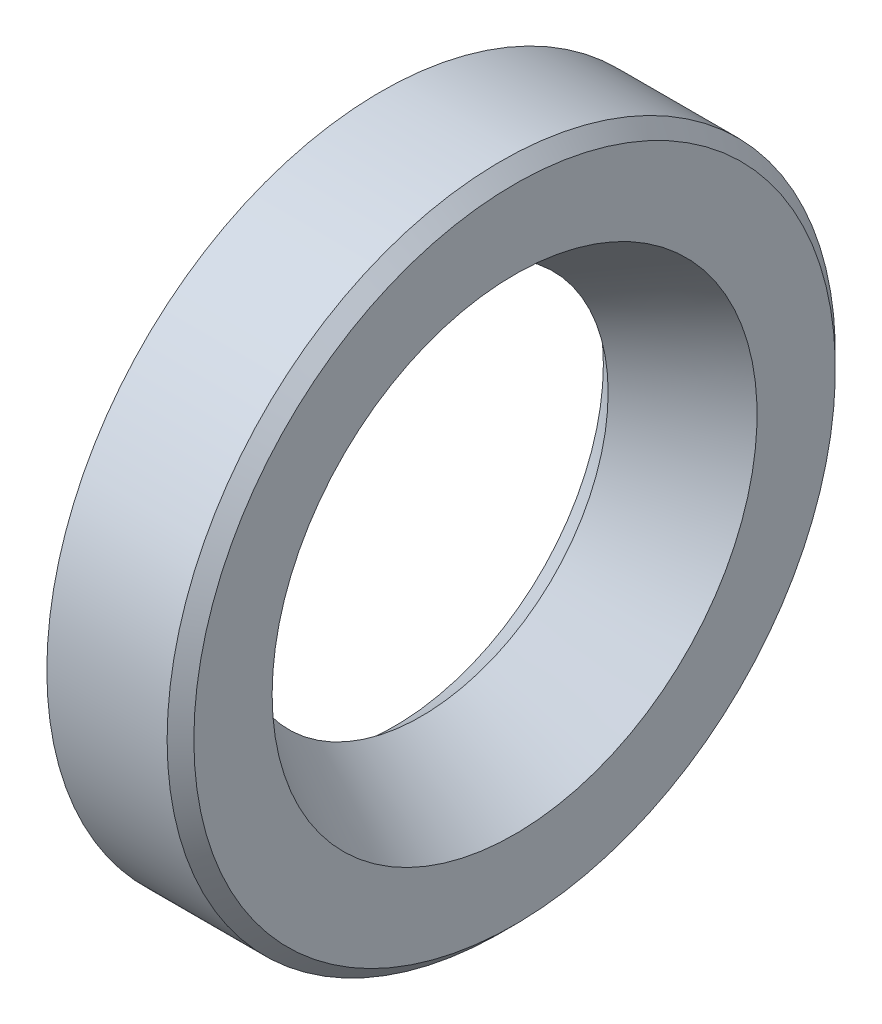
from build123d import *


with BuildPart() as part:
    # Ske → Base-Rev (revolve)
    with BuildSketch(Plane.XY, mode=Mode.PRIVATE) as base_rev_sk:
        with BuildLine():
            Line((2, 18.142857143), (1, 18.142857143))
            Line((1, 18.142857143), (1, 15.641731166))
            Line((1, 15.641731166), (3, 14))
            Line((3, 14), (10, 18.142857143))
            Line((10, 18.142857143), (10, 24))
            Line((10, 24), (9, 25))
            Line((9, 25), (0, 25))
            Line((0, 25), (0, 23.222222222))
            Line((0, 23.222222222), (5.666666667, 23.222222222))
            ThreePointArc((5.666666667, 23.222222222), (6.373773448, 22.929329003), (6.666666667, 22.222222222))
            Line((6.666666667, 22.222222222), (6.666666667, 18.142857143))
            ThreePointArc((6.666666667, 18.142857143), (6.373773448, 17.435750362), (5.666666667, 17.142857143))
            Line((5.666666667, 17.142857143), (3, 17.142857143))
            ThreePointArc((3, 17.142857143), (3.707106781, 18.849963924), (2, 18.142857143))
        make_face()
    revolve(base_rev_sk.sketch.rotate(Axis((-10, 0, 0), (1, 0, 0)), 90), axis=Axis((-10, 0, 0), (1, 0, 0)))


solid = part.part
